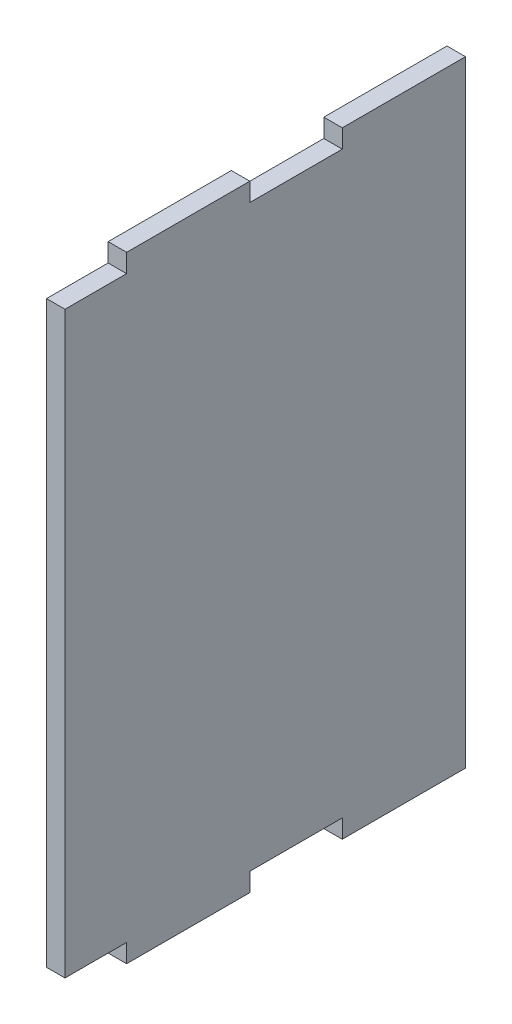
from build123d import *

# Parameters (mm, degrees)
SKETCH_3_W          = 65
SKETCH_3_H          = 100
EXTRUDE_2_DEPTH     = 3
SKETCH_4_W          = 10
SKETCH_4_H          = 3
SKETCH_4_W_2        = 15
CUT_EXTRUDE_1_DEPTH = 3


with BuildPart() as part:
    # Sketch 3 → Extrude 2 (new body)
    with BuildSketch(Plane(origin=(0, 0, 0), x_dir=(0, 0, -1), z_dir=(1, 0, 0))):
        with Locations((-29.573350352, 9.277600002)):
            Rectangle(SKETCH_3_W, SKETCH_3_H)
    extrude(amount=EXTRUDE_2_DEPTH)

    # Sketch 4 → Cut-Extrude 1 (cut)
    with BuildSketch(Plane(origin=(3, 0, 0), x_dir=(0, 0, -1), z_dir=(1, 0, 0))):
        with Locations((-57.073350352, -39.222399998)):
            Rectangle(SKETCH_4_W, SKETCH_4_H)
        with Locations((-24.573350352, -39.222399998)):
            Rectangle(SKETCH_4_W_2, SKETCH_4_H)
        with Locations((-24.573350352, 57.777600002)):
            Rectangle(SKETCH_4_W_2, SKETCH_4_H)
        with Locations((-57.073350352, 57.777600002)):
            Rectangle(SKETCH_4_W, SKETCH_4_H)
    extrude(amount=-CUT_EXTRUDE_1_DEPTH, mode=Mode.SUBTRACT)


solid = part.part
